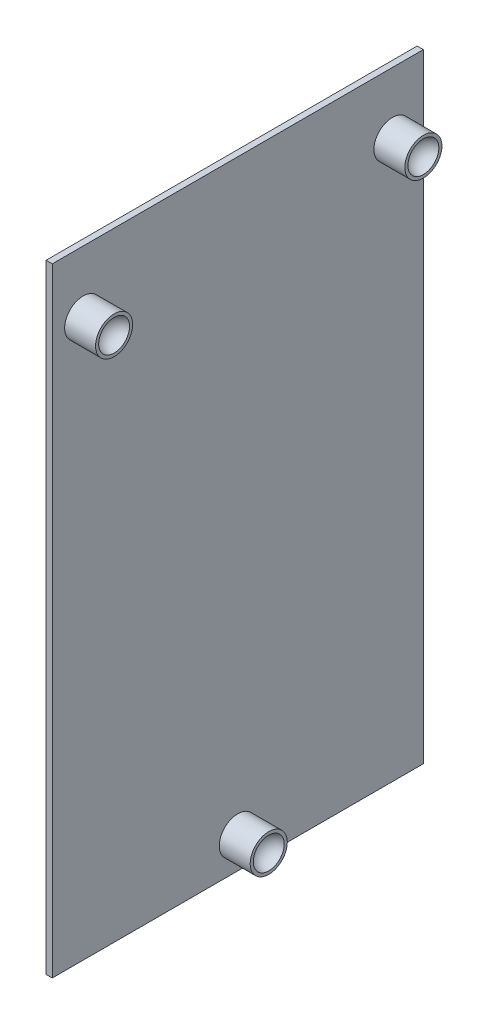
from build123d import *

# Parameters (mm, degrees)
SKETCH1_W           = 1200
SKETCH1_H           = 2000
BOSS_EXTRUDE1_DEPTH = 20


with BuildPart() as part:
    # Sketch1 → Boss-Extrude1 (new body)
    with BuildSketch(Plane(origin=(0, 0, 0), x_dir=(0, 0, -1), z_dir=(1, 0, 0))):
        with Locations((0, 1000)):
            Rectangle(SKETCH1_W, SKETCH1_H)
    extrude(amount=-BOSS_EXTRUDE1_DEPTH)

    # Sketch2 → Revolve1 (revolve)
    with BuildSketch(Plane.XY):
        with BuildLine():
            Line((0, 40), (100, 40))
            Line((100, 40), (100, 50))
            ThreePointArc((100, 50), (64.644660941, 64.644660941), (50, 100))
            Line((50, 100), (0, 100))
            Line((0, 100), (0, 40))
        make_face()
    revolve(axis=Axis((0, 100, 0), (1, 0, 0)))

    # Sketch4 → Revolve2 (revolve)
    with BuildSketch(Plane.XY.offset(500), mode=Mode.PRIVATE) as revolve2_sk:
        with BuildLine():
            Line((0, 1740), (100, 1740))
            Line((100, 1740), (100, 1750))
            ThreePointArc((100, 1750), (64.644660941, 1764.644660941), (50, 1800))
            Line((50, 1800), (0, 1800))
            Line((0, 1800), (0, 1740))
        make_face()
    revolve2 = revolve(revolve2_sk.sketch.rotate(Axis((0, 1800, 500), (1, 0, 0)), 270), axis=Axis((0, 1800, 500), (1, 0, 0)))

    # Mirror1: Revolve2 across plane
    add(revolve2.mirror(Plane.XY))


solid = part.part
